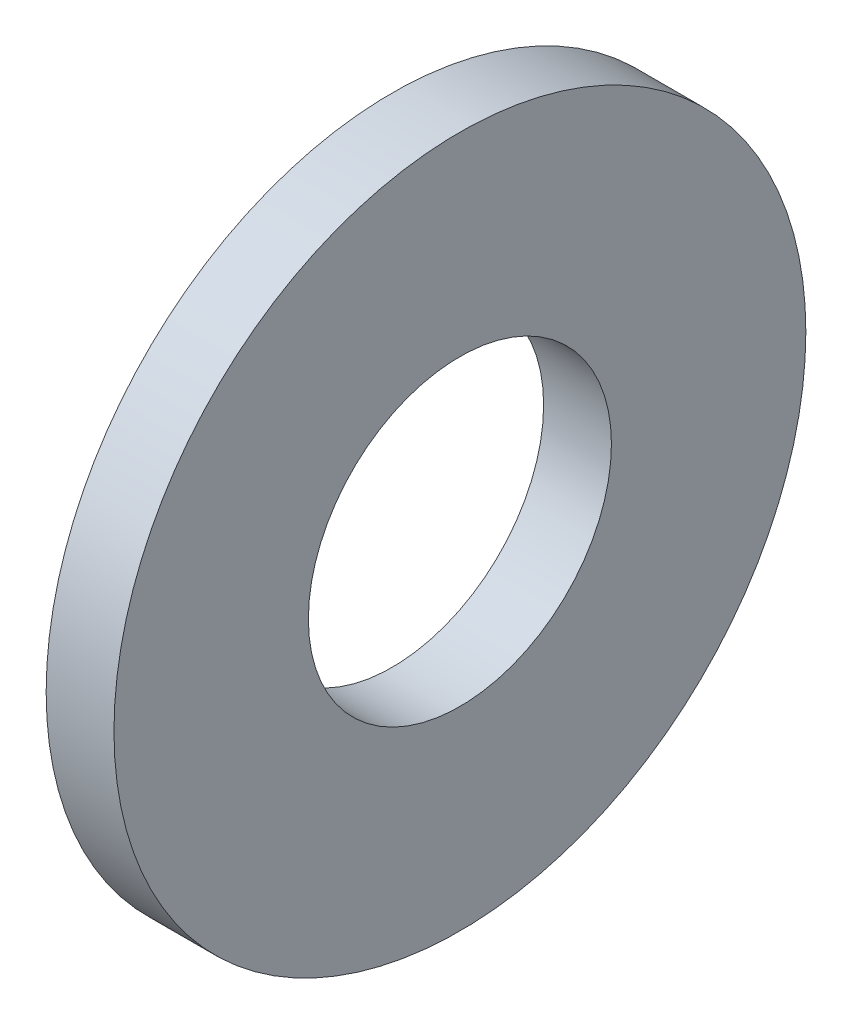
from build123d import *

# Parameters (mm, degrees)
SKETCH1_W = 1.2446
SKETCH1_H = 3.5687


with BuildPart() as part:
    # Sketch1 → Base-Revolve (revolve)
    with BuildSketch(Plane.XY, mode=Mode.PRIVATE) as base_revolve_sk:
        with Locations((-0.6223, 4.56565)):
            Rectangle(SKETCH1_W, SKETCH1_H)
    revolve(base_revolve_sk.sketch.rotate(Axis((-34.925, 0, 0), (1, 0, 0)), 90), axis=Axis((-34.925, 0, 0), (1, 0, 0)))


solid = part.part
